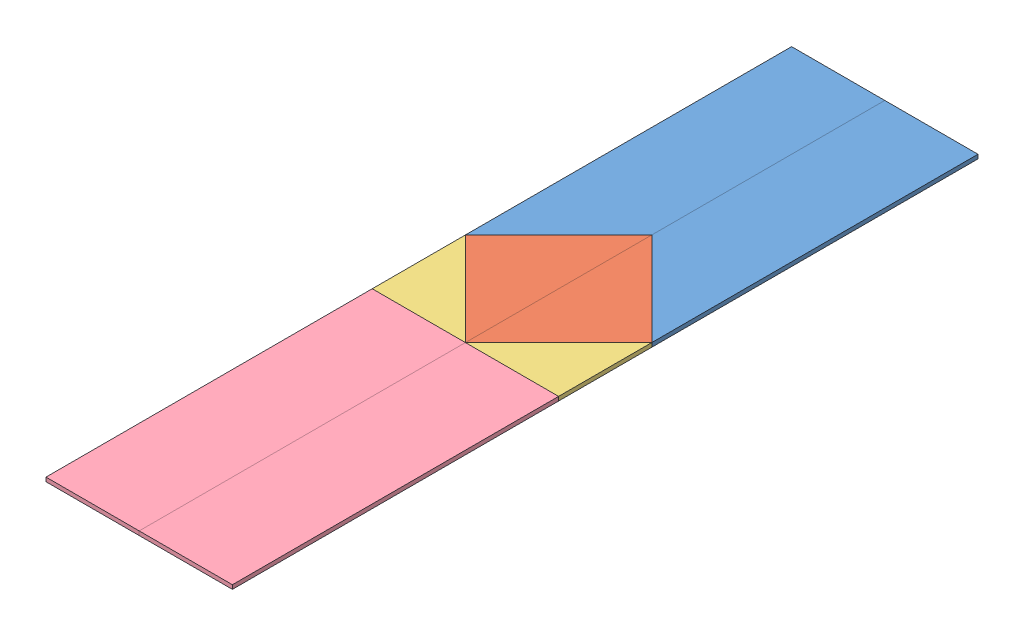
SolidWorks assembly Assem1.SLDASM, configuration Default (file format 14000). Lengths in mm.
Overall size (46 1 184).
8 component instances, 4 part files, 23 mates.
Components (placement in the parent):
- Boss-Extrude2-1: Boss-Extrude2.SLDPRT [Default] at (6.7823 44.795 209.5172) size (23 1 80.5)
- Boss-Extrude3-1: Boss-Extrude3.SLDPRT [Default] at (6.7823 44.795 209.5172) size (23 1 46)
- Boss-Extrude5-1: Boss-Extrude5.SLDPRT [Default] at (6.7823 44.795 209.5172) size (23 1 23)
- Boss-Extrude6-1: Boss-Extrude6.SLDPRT [Default] at (6.7823 44.795 209.5172) size (23 1 80.5)
- Boss-Extrude2-2: Boss-Extrude2.SLDPRT [Default] at (52.7823 45.795 209.5172) x (-1 0 0) z (0 0 1) size (23 1 80.5)
- Boss-Extrude3-2: Boss-Extrude3.SLDPRT [Default] at (52.7823 45.795 209.5172) x (-1 0 0) z (0 0 1) size (23 1 46)
- Boss-Extrude5-2: Boss-Extrude5.SLDPRT [Default] at (52.7823 45.795 209.5172) x (-1 0 0) z (0 0 1) size (23 1 23)
- Boss-Extrude6-2: Boss-Extrude6.SLDPRT [Default] at (29.7823 44.795 209.5172) size (23 1 80.5)
Mates (geometry in assembly coordinates):
- Coincident1: coincident: point of Boss-Extrude2-1; point of Boss-Extrude3-1
- Coincident2: coincident: point of Boss-Extrude2-1; point of Boss-Extrude3-1
- Coincident3: coincident: point of Boss-Extrude3-1; point of Boss-Extrude5-1
- Coincident4: coincident: point of Boss-Extrude3-1; point of Boss-Extrude5-1
- Coincident5: coincident: point of Boss-Extrude3-1; point of Boss-Extrude6-1
- Coincident7: coincident: point of Boss-Extrude5-1; point of Boss-Extrude6-1
- Coincident8: coincident: point of Boss-Extrude2-1; point of Boss-Extrude2-2
- Coincident9: coincident: point of Boss-Extrude2-1; point of Boss-Extrude2-2
- Coincident10: coincident: point of Boss-Extrude2-2; point of Boss-Extrude3-2
- Coincident11: coincident: point of Boss-Extrude2-2; point of Boss-Extrude3-2
- Coincident12: coincident: point of Boss-Extrude5-1; point of Boss-Extrude3-2
- Coincident13: coincident: point of Boss-Extrude5-1; point of Boss-Extrude5-2
- Coincident14: coincident: point of Boss-Extrude3-2; point of Boss-Extrude5-2
- Coincident15: coincident: point of Boss-Extrude6-1; point of Boss-Extrude6-2
- Coincident16: coincident: point of Boss-Extrude5-2; point of Boss-Extrude6-2
- Coincident17: coincident: point of Boss-Extrude6-1; point of Boss-Extrude6-2
- Parallel1: parallel aligned: plane of Boss-Extrude2-1 through (6.7823 45.795 209.5172) normal (0 1 0); plane of Boss-Extrude2-2 through (52.7823 45.795 209.5172) normal (0 1 0)
- Parallel2: parallel aligned: plane of Boss-Extrude2-1 through (6.7823 45.795 209.5172) normal (0 1 0); plane of Boss-Extrude3-1 through (6.7823 45.795 209.5172) normal (0 1 0)
- Parallel3: parallel aligned: plane of Boss-Extrude3-1 through (6.7823 45.795 209.5172) normal (0 1 0); plane of Boss-Extrude5-1 through (6.7823 45.795 209.5172) normal (0 1 0)
- Parallel4: parallel aligned: plane of Boss-Extrude5-1 through (6.7823 45.795 209.5172) normal (0 1 0); plane of Boss-Extrude6-1 through (6.7823 45.795 209.5172) normal (0 1 0)
- Parallel5: parallel aligned: plane of Boss-Extrude2-1 through (6.7823 45.795 209.5172) normal (0 1 0); plane of Boss-Extrude3-2 through (52.7823 45.795 209.5172) normal (0 1 0)
- Parallel6: parallel aligned: plane of Boss-Extrude2-1 through (6.7823 45.795 209.5172) normal (0 1 0); plane of Boss-Extrude5-2 through (52.7823 45.795 209.5172) normal (0 1 0)
- Parallel7: parallel aligned: plane of Boss-Extrude2-1 through (6.7823 45.795 209.5172) normal (0 1 0); plane of Boss-Extrude6-2 through (29.7823 45.795 209.5172) normal (0 1 0)
